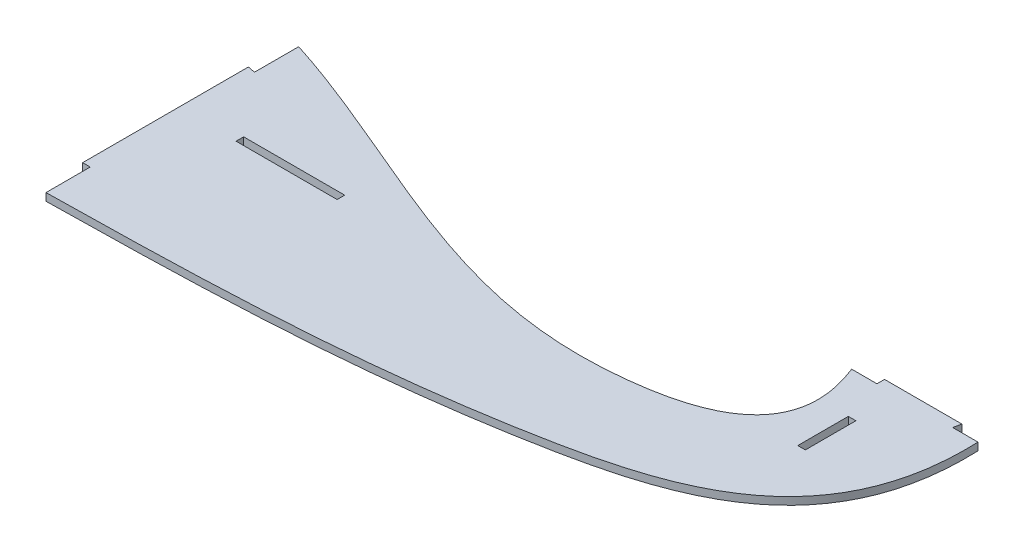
ISO-10303-21;
HEADER;
FILE_DESCRIPTION(('STEP AP214'),'2;1');
FILE_NAME('part.step','',(''),(''),'','','');
FILE_SCHEMA(('AUTOMOTIVE_DESIGN { 1 0 10303 214 1 1 1 1 }'));
ENDSEC;
DATA;
#1=APPLICATION_CONTEXT('core data for automotive mechanical design processes');
#2=APPLICATION_PROTOCOL_DEFINITION('international standard','automotive_design',2000,#1);
#3=PRODUCT_CONTEXT('',#1,'mechanical');
#4=PRODUCT('Part','Part','',(#3));
#5=PRODUCT_RELATED_PRODUCT_CATEGORY('part','',(#4));
#6=PRODUCT_DEFINITION_FORMATION('','',#4);
#7=PRODUCT_DEFINITION_CONTEXT('part definition',#1,'design');
#8=PRODUCT_DEFINITION('design','',#6,#7);
#9=PRODUCT_DEFINITION_SHAPE('','',#8);
#10=(LENGTH_UNIT() NAMED_UNIT(*) SI_UNIT(.MILLI.,.METRE.));
#11=(NAMED_UNIT(*) PLANE_ANGLE_UNIT() SI_UNIT($,.RADIAN.));
#12=(NAMED_UNIT(*) SI_UNIT($,.STERADIAN.) SOLID_ANGLE_UNIT());
#13=UNCERTAINTY_MEASURE_WITH_UNIT(LENGTH_MEASURE(1.E-05),#10,'distance_accuracy_value','');
#14=(GEOMETRIC_REPRESENTATION_CONTEXT(3) GLOBAL_UNCERTAINTY_ASSIGNED_CONTEXT((#13)) GLOBAL_UNIT_ASSIGNED_CONTEXT((#10,
#11,#12)) REPRESENTATION_CONTEXT('',''));
#15=CARTESIAN_POINT('',(0.,0.,0.));
#16=DIRECTION('',(0.,0.,1.));
#17=DIRECTION('',(1.,0.,0.));
#18=AXIS2_PLACEMENT_3D('',#15,#16,#17);
#19=CARTESIAN_POINT('',(-49.2266900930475,3.,7.72471878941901));
#20=DIRECTION('',(0.,-1.,0.));
#21=DIRECTION('',(0.,0.,-1.));
#22=AXIS2_PLACEMENT_3D('',#19,#20,#21);
#23=PLANE('',#22);
#24=DIRECTION('',(0.,0.,1.));
#25=VECTOR('',#24,1.);
#26=CARTESIAN_POINT('',(-186.035113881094,3.,-40.7173480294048));
#27=LINE('',#26,#25);
#28=CARTESIAN_POINT('',(-186.035113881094,3.,-40.7173480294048));
#29=VERTEX_POINT('',#28);
#30=CARTESIAN_POINT('',(-186.035113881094,3.,-37.7173480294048));
#31=VERTEX_POINT('',#30);
#32=EDGE_CURVE('E206',#29,#31,#27,.T.);
#33=ORIENTED_EDGE('',*,*,#32,.F.);
#34=DIRECTION('',(-1.,0.,0.));
#35=VECTOR('',#34,1.);
#36=CARTESIAN_POINT('',(-186.035113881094,3.,-40.7173480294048));
#37=LINE('',#36,#35);
#38=CARTESIAN_POINT('',(-146.035113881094,3.,-40.7173480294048));
#39=VERTEX_POINT('',#38);
#40=EDGE_CURVE('E214',#39,#29,#37,.T.);
#41=ORIENTED_EDGE('',*,*,#40,.F.);
#42=DIRECTION('',(0.,0.,-1.));
#43=VECTOR('',#42,1.);
#44=CARTESIAN_POINT('',(-146.035113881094,3.,-40.7173480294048));
#45=LINE('',#44,#43);
#46=CARTESIAN_POINT('',(-146.035113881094,3.,-37.7173480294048));
#47=VERTEX_POINT('',#46);
#48=EDGE_CURVE('E211',#47,#39,#45,.T.);
#49=ORIENTED_EDGE('',*,*,#48,.F.);
#50=DIRECTION('',(1.,0.,0.));
#51=VECTOR('',#50,1.);
#52=CARTESIAN_POINT('',(-186.035113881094,3.,-37.7173480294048));
#53=LINE('',#52,#51);
#54=EDGE_CURVE('E208',#31,#47,#53,.T.);
#55=ORIENTED_EDGE('',*,*,#54,.F.);
#56=EDGE_LOOP('',(#33,#41,#49,#55));
#57=FACE_BOUND('',#56,.T.);
#58=DIRECTION('',(-0.98058067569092,0.,-0.196116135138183));
#59=VECTOR('',#58,1.);
#60=CARTESIAN_POINT('',(-206.035113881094,3.,-65.));
#61=LINE('',#60,#59);
#62=CARTESIAN_POINT('',(-206.035113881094,3.,-65.));
#63=VERTEX_POINT('',#62);
#64=CARTESIAN_POINT('',(-209.035113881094,3.,-65.6));
#65=VERTEX_POINT('',#64);
#66=EDGE_CURVE('E237',#63,#65,#61,.T.);
#67=ORIENTED_EDGE('',*,*,#66,.T.);
#68=DIRECTION('',(0.,0.,1.));
#69=VECTOR('',#68,1.);
#70=CARTESIAN_POINT('',(-209.035113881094,3.,-65.6));
#71=LINE('',#70,#69);
#72=CARTESIAN_POINT('',(-209.035113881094,3.,0.));
#73=VERTEX_POINT('',#72);
#74=EDGE_CURVE('E240',#65,#73,#71,.T.);
#75=ORIENTED_EDGE('',*,*,#74,.T.);
#76=DIRECTION('',(1.,0.,0.));
#77=VECTOR('',#76,1.);
#78=CARTESIAN_POINT('',(-209.035113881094,3.,0.));
#79=LINE('',#78,#77);
#80=CARTESIAN_POINT('',(-206.035113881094,3.,0.));
#81=VERTEX_POINT('',#80);
#82=EDGE_CURVE('E243',#73,#81,#79,.T.);
#83=ORIENTED_EDGE('',*,*,#82,.T.);
#84=DIRECTION('',(0.,0.,1.));
#85=VECTOR('',#84,1.);
#86=CARTESIAN_POINT('',(-206.035113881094,3.,0.));
#87=LINE('',#86,#85);
#88=CARTESIAN_POINT('',(-206.035113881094,3.,17.5));
#89=VERTEX_POINT('',#88);
#90=EDGE_CURVE('E245',#81,#89,#87,.T.);
#91=ORIENTED_EDGE('',*,*,#90,.T.);
#92=CARTESIAN_POINT('',(-206.035113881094,3.,17.5));
#93=CARTESIAN_POINT('',(-144.452135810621,3.,16.5478589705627));
#94=CARTESIAN_POINT('',(-43.3392895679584,3.,14.1173539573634));
#95=CARTESIAN_POINT('',(66.3683103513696,3.,-18.6536348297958));
#96=CARTESIAN_POINT('',(63.928148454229,3.,-81.402504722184));
#97=B_SPLINE_CURVE_WITH_KNOTS('',3,(#92,#93,#94,#95,#96),.UNSPECIFIED.,.F.,.F.,(4,1,4),(0.,
0.576577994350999,1.),.UNSPECIFIED.);
#98=CARTESIAN_POINT('',(63.928148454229,3.,-81.402504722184));
#99=VERTEX_POINT('',#98);
#100=EDGE_CURVE('E247',#89,#99,#97,.T.);
#101=ORIENTED_EDGE('',*,*,#100,.T.);
#102=DIRECTION('',(-1.,0.,0.));
#103=VECTOR('',#102,1.);
#104=CARTESIAN_POINT('',(53.9281484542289,3.,-81.402504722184));
#105=LINE('',#104,#103);
#106=CARTESIAN_POINT('',(53.9281484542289,3.,-81.402504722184));
#107=VERTEX_POINT('',#106);
#108=EDGE_CURVE('E252',#99,#107,#105,.T.);
#109=ORIENTED_EDGE('',*,*,#108,.T.);
#110=DIRECTION('',(0.196116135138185,0.,-0.98058067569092));
#111=VECTOR('',#110,1.);
#112=CARTESIAN_POINT('',(53.9281484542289,3.,-81.402504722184));
#113=LINE('',#112,#111);
#114=CARTESIAN_POINT('',(54.5281484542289,3.,-84.402504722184));
#115=VERTEX_POINT('',#114);
#116=EDGE_CURVE('E425',#107,#115,#113,.T.);
#117=ORIENTED_EDGE('',*,*,#116,.T.);
#118=DIRECTION('',(-1.,0.,0.));
#119=VECTOR('',#118,1.);
#120=CARTESIAN_POINT('',(54.5281484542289,3.,-84.402504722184));
#121=LINE('',#120,#119);
#122=CARTESIAN_POINT('',(23.9281484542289,3.,-84.402504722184));
#123=VERTEX_POINT('',#122);
#124=EDGE_CURVE('E420',#115,#123,#121,.T.);
#125=ORIENTED_EDGE('',*,*,#124,.T.);
#126=DIRECTION('',(0.,0.,1.));
#127=VECTOR('',#126,1.);
#128=CARTESIAN_POINT('',(23.9281484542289,3.,-81.402504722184));
#129=LINE('',#128,#127);
#130=CARTESIAN_POINT('',(23.9281484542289,3.,-81.402504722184));
#131=VERTEX_POINT('',#130);
#132=EDGE_CURVE('E416',#123,#131,#129,.T.);
#133=ORIENTED_EDGE('',*,*,#132,.T.);
#134=DIRECTION('',(-1.,0.,0.));
#135=VECTOR('',#134,1.);
#136=CARTESIAN_POINT('',(13.9281484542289,3.,-81.402504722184));
#137=LINE('',#136,#135);
#138=CARTESIAN_POINT('',(13.9281484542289,3.,-81.402504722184));
#139=VERTEX_POINT('',#138);
#140=EDGE_CURVE('E312',#131,#139,#137,.T.);
#141=ORIENTED_EDGE('',*,*,#140,.T.);
#142=CARTESIAN_POINT('',(13.9281484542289,3.,-81.402504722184));
#143=CARTESIAN_POINT('',(27.9213090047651,3.,-46.249992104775));
#144=CARTESIAN_POINT('',(-17.8825562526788,3.,-30.4404603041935));
#145=CARTESIAN_POINT('',(-103.735826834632,3.,-34.1507342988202));
#146=CARTESIAN_POINT('',(-161.754644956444,3.,-68.5041270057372));
#147=CARTESIAN_POINT('',(-206.035113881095,3.,-82.5));
#148=B_SPLINE_CURVE_WITH_KNOTS('',3,(#142,#143,#144,#145,#146,#147),.UNSPECIFIED.,.F.,.F.,(4,1,
1,4),(0.,0.276728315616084,0.458837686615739,1.),.UNSPECIFIED.);
#149=CARTESIAN_POINT('',(-206.035113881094,3.,-82.5));
#150=VERTEX_POINT('',#149);
#151=EDGE_CURVE('E305',#139,#150,#148,.T.);
#152=ORIENTED_EDGE('',*,*,#151,.T.);
#153=DIRECTION('',(0.,0.,1.));
#154=VECTOR('',#153,1.);
#155=CARTESIAN_POINT('',(-206.035113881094,3.,-82.5));
#156=LINE('',#155,#154);
#157=EDGE_CURVE('E311',#150,#63,#156,.T.);
#158=ORIENTED_EDGE('',*,*,#157,.T.);
#159=EDGE_LOOP('',(#67,#75,#83,#91,#101,#109,#117,#125,#133,#141,#152,#158));
#160=FACE_BOUND('',#159,.T.);
#161=DIRECTION('',(0.,0.,1.));
#162=VECTOR('',#161,1.);
#163=CARTESIAN_POINT('',(29.4459579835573,3.,-64.5480450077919));
#164=LINE('',#163,#162);
#165=CARTESIAN_POINT('',(29.4459579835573,3.,-64.5480450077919));
#166=VERTEX_POINT('',#165);
#167=CARTESIAN_POINT('',(29.4459579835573,3.,-44.5480450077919));
#168=VERTEX_POINT('',#167);
#169=EDGE_CURVE('E170',#166,#168,#164,.T.);
#170=ORIENTED_EDGE('',*,*,#169,.F.);
#171=DIRECTION('',(-1.,0.,0.));
#172=VECTOR('',#171,1.);
#173=CARTESIAN_POINT('',(29.4459579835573,3.,-64.5480450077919));
#174=LINE('',#173,#172);
#175=CARTESIAN_POINT('',(32.4459579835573,3.,-64.5480450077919));
#176=VERTEX_POINT('',#175);
#177=EDGE_CURVE('E192',#176,#166,#174,.T.);
#178=ORIENTED_EDGE('',*,*,#177,.F.);
#179=DIRECTION('',(0.,0.,-1.));
#180=VECTOR('',#179,1.);
#181=CARTESIAN_POINT('',(32.4459579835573,3.,-64.5480450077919));
#182=LINE('',#181,#180);
#183=CARTESIAN_POINT('',(32.4459579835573,3.,-44.5480450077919));
#184=VERTEX_POINT('',#183);
#185=EDGE_CURVE('E190',#184,#176,#182,.T.);
#186=ORIENTED_EDGE('',*,*,#185,.F.);
#187=DIRECTION('',(1.,0.,0.));
#188=VECTOR('',#187,1.);
#189=CARTESIAN_POINT('',(29.4459579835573,3.,-44.5480450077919));
#190=LINE('',#189,#188);
#191=EDGE_CURVE('E178',#168,#184,#190,.T.);
#192=ORIENTED_EDGE('',*,*,#191,.F.);
#193=EDGE_LOOP('',(#170,#178,#186,#192));
#194=FACE_BOUND('',#193,.T.);
#195=ADVANCED_FACE('F33',(#57,#160,#194),#23,.F.);
#196=CARTESIAN_POINT('',(-49.2266900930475,0.,7.72471878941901));
#197=DIRECTION('',(0.,-1.,0.));
#198=DIRECTION('',(0.,0.,-1.));
#199=AXIS2_PLACEMENT_3D('',#196,#197,#198);
#200=PLANE('',#199);
#201=DIRECTION('',(-0.98058067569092,0.,-0.196116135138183));
#202=VECTOR('',#201,1.);
#203=CARTESIAN_POINT('',(-206.035113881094,0.,-65.));
#204=LINE('',#203,#202);
#205=CARTESIAN_POINT('',(-206.035113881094,0.,-65.));
#206=VERTEX_POINT('',#205);
#207=CARTESIAN_POINT('',(-209.035113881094,0.,-65.6));
#208=VERTEX_POINT('',#207);
#209=EDGE_CURVE('E236',#206,#208,#204,.T.);
#210=ORIENTED_EDGE('',*,*,#209,.F.);
#211=DIRECTION('',(0.,0.,1.));
#212=VECTOR('',#211,1.);
#213=CARTESIAN_POINT('',(-206.035113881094,0.,-82.5));
#214=LINE('',#213,#212);
#215=CARTESIAN_POINT('',(-206.035113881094,0.,-82.5));
#216=VERTEX_POINT('',#215);
#217=EDGE_CURVE('E241',#216,#206,#214,.T.);
#218=ORIENTED_EDGE('',*,*,#217,.F.);
#219=CARTESIAN_POINT('',(13.9281484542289,0.,-81.402504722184));
#220=CARTESIAN_POINT('',(27.9213090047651,0.,-46.249992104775));
#221=CARTESIAN_POINT('',(-17.8825562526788,0.,-30.4404603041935));
#222=CARTESIAN_POINT('',(-103.735826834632,0.,-34.1507342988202));
#223=CARTESIAN_POINT('',(-161.754644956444,0.,-68.5041270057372));
#224=CARTESIAN_POINT('',(-206.035113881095,0.,-82.5));
#225=B_SPLINE_CURVE_WITH_KNOTS('',3,(#219,#220,#221,#222,#223,#224),.UNSPECIFIED.,.F.,.F.,(4,1,
1,4),(0.,0.276728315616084,0.458837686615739,1.),.UNSPECIFIED.);
#226=CARTESIAN_POINT('',(13.9281484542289,0.,-81.402504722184));
#227=VERTEX_POINT('',#226);
#228=EDGE_CURVE('E345',#227,#216,#225,.T.);
#229=ORIENTED_EDGE('',*,*,#228,.F.);
#230=DIRECTION('',(-1.,0.,0.));
#231=VECTOR('',#230,1.);
#232=CARTESIAN_POINT('',(13.9281484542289,0.,-81.402504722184));
#233=LINE('',#232,#231);
#234=CARTESIAN_POINT('',(23.9281484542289,0.,-81.402504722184));
#235=VERTEX_POINT('',#234);
#236=EDGE_CURVE('E343',#235,#227,#233,.T.);
#237=ORIENTED_EDGE('',*,*,#236,.F.);
#238=DIRECTION('',(0.,0.,1.));
#239=VECTOR('',#238,1.);
#240=CARTESIAN_POINT('',(23.9281484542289,0.,-81.402504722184));
#241=LINE('',#240,#239);
#242=CARTESIAN_POINT('',(23.9281484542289,0.,-84.402504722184));
#243=VERTEX_POINT('',#242);
#244=EDGE_CURVE('E341',#243,#235,#241,.T.);
#245=ORIENTED_EDGE('',*,*,#244,.F.);
#246=DIRECTION('',(-1.,0.,0.));
#247=VECTOR('',#246,1.);
#248=CARTESIAN_POINT('',(23.9281484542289,0.,-84.402504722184));
#249=LINE('',#248,#247);
#250=CARTESIAN_POINT('',(54.5281484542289,0.,-84.402504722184));
#251=VERTEX_POINT('',#250);
#252=EDGE_CURVE('E339',#251,#243,#249,.T.);
#253=ORIENTED_EDGE('',*,*,#252,.F.);
#254=DIRECTION('',(0.196116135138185,0.,-0.98058067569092));
#255=VECTOR('',#254,1.);
#256=CARTESIAN_POINT('',(53.9281484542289,0.,-81.402504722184));
#257=LINE('',#256,#255);
#258=CARTESIAN_POINT('',(53.9281484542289,0.,-81.402504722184));
#259=VERTEX_POINT('',#258);
#260=EDGE_CURVE('E336',#259,#251,#257,.T.);
#261=ORIENTED_EDGE('',*,*,#260,.F.);
#262=DIRECTION('',(-1.,0.,0.));
#263=VECTOR('',#262,1.);
#264=CARTESIAN_POINT('',(53.9281484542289,0.,-81.402504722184));
#265=LINE('',#264,#263);
#266=CARTESIAN_POINT('',(63.928148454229,0.,-81.402504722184));
#267=VERTEX_POINT('',#266);
#268=EDGE_CURVE('E331',#267,#259,#265,.T.);
#269=ORIENTED_EDGE('',*,*,#268,.F.);
#270=CARTESIAN_POINT('',(-206.035113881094,0.,17.5));
#271=CARTESIAN_POINT('',(-144.452135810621,0.,16.5478589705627));
#272=CARTESIAN_POINT('',(-43.3392895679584,0.,14.1173539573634));
#273=CARTESIAN_POINT('',(66.3683103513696,0.,-18.6536348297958));
#274=CARTESIAN_POINT('',(63.928148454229,0.,-81.402504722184));
#275=B_SPLINE_CURVE_WITH_KNOTS('',3,(#270,#271,#272,#273,#274),.UNSPECIFIED.,.F.,.F.,(4,1,4),
(0.,0.576577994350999,1.),.UNSPECIFIED.);
#276=CARTESIAN_POINT('',(-206.035113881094,0.,17.5));
#277=VERTEX_POINT('',#276);
#278=EDGE_CURVE('E327',#277,#267,#275,.T.);
#279=ORIENTED_EDGE('',*,*,#278,.F.);
#280=DIRECTION('',(0.,0.,1.));
#281=VECTOR('',#280,1.);
#282=CARTESIAN_POINT('',(-206.035113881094,0.,0.));
#283=LINE('',#282,#281);
#284=CARTESIAN_POINT('',(-206.035113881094,0.,0.));
#285=VERTEX_POINT('',#284);
#286=EDGE_CURVE('E325',#285,#277,#283,.T.);
#287=ORIENTED_EDGE('',*,*,#286,.F.);
#288=DIRECTION('',(1.,0.,0.));
#289=VECTOR('',#288,1.);
#290=CARTESIAN_POINT('',(-209.035113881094,0.,0.));
#291=LINE('',#290,#289);
#292=CARTESIAN_POINT('',(-209.035113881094,0.,0.));
#293=VERTEX_POINT('',#292);
#294=EDGE_CURVE('E323',#293,#285,#291,.T.);
#295=ORIENTED_EDGE('',*,*,#294,.F.);
#296=DIRECTION('',(0.,0.,1.));
#297=VECTOR('',#296,1.);
#298=CARTESIAN_POINT('',(-209.035113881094,0.,-65.));
#299=LINE('',#298,#297);
#300=EDGE_CURVE('E321',#208,#293,#299,.T.);
#301=ORIENTED_EDGE('',*,*,#300,.F.);
#302=EDGE_LOOP('',(#210,#218,#229,#237,#245,#253,#261,#269,#279,#287,#295,#301));
#303=FACE_BOUND('',#302,.T.);
#304=DIRECTION('',(-1.,0.,0.));
#305=VECTOR('',#304,1.);
#306=CARTESIAN_POINT('',(-186.035113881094,0.,-40.7173480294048));
#307=LINE('',#306,#305);
#308=CARTESIAN_POINT('',(-146.035113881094,0.,-40.7173480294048));
#309=VERTEX_POINT('',#308);
#310=CARTESIAN_POINT('',(-186.035113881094,0.,-40.7173480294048));
#311=VERTEX_POINT('',#310);
#312=EDGE_CURVE('E209',#309,#311,#307,.T.);
#313=ORIENTED_EDGE('',*,*,#312,.T.);
#314=DIRECTION('',(0.,0.,1.));
#315=VECTOR('',#314,1.);
#316=CARTESIAN_POINT('',(-186.035113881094,0.,-40.7173480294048));
#317=LINE('',#316,#315);
#318=CARTESIAN_POINT('',(-186.035113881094,0.,-37.7173480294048));
#319=VERTEX_POINT('',#318);
#320=EDGE_CURVE('E186',#311,#319,#317,.T.);
#321=ORIENTED_EDGE('',*,*,#320,.T.);
#322=DIRECTION('',(1.,0.,0.));
#323=VECTOR('',#322,1.);
#324=CARTESIAN_POINT('',(-186.035113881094,0.,-37.7173480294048));
#325=LINE('',#324,#323);
#326=CARTESIAN_POINT('',(-146.035113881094,0.,-37.7173480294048));
#327=VERTEX_POINT('',#326);
#328=EDGE_CURVE('E219',#319,#327,#325,.T.);
#329=ORIENTED_EDGE('',*,*,#328,.T.);
#330=DIRECTION('',(0.,0.,-1.));
#331=VECTOR('',#330,1.);
#332=CARTESIAN_POINT('',(-146.035113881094,0.,-40.7173480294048));
#333=LINE('',#332,#331);
#334=EDGE_CURVE('E222',#327,#309,#333,.T.);
#335=ORIENTED_EDGE('',*,*,#334,.T.);
#336=EDGE_LOOP('',(#313,#321,#329,#335));
#337=FACE_BOUND('',#336,.T.);
#338=DIRECTION('',(-1.,0.,0.));
#339=VECTOR('',#338,1.);
#340=CARTESIAN_POINT('',(29.4459579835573,0.,-64.5480450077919));
#341=LINE('',#340,#339);
#342=CARTESIAN_POINT('',(32.4459579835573,0.,-64.5480450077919));
#343=VERTEX_POINT('',#342);
#344=CARTESIAN_POINT('',(29.4459579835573,0.,-64.5480450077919));
#345=VERTEX_POINT('',#344);
#346=EDGE_CURVE('E179',#343,#345,#341,.T.);
#347=ORIENTED_EDGE('',*,*,#346,.T.);
#348=DIRECTION('',(0.,0.,1.));
#349=VECTOR('',#348,1.);
#350=CARTESIAN_POINT('',(29.4459579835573,0.,-64.5480450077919));
#351=LINE('',#350,#349);
#352=CARTESIAN_POINT('',(29.4459579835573,0.,-44.5480450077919));
#353=VERTEX_POINT('',#352);
#354=EDGE_CURVE('E56',#345,#353,#351,.T.);
#355=ORIENTED_EDGE('',*,*,#354,.T.);
#356=DIRECTION('',(1.,0.,0.));
#357=VECTOR('',#356,1.);
#358=CARTESIAN_POINT('',(29.4459579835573,0.,-44.5480450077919));
#359=LINE('',#358,#357);
#360=CARTESIAN_POINT('',(32.4459579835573,0.,-44.5480450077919));
#361=VERTEX_POINT('',#360);
#362=EDGE_CURVE('E185',#353,#361,#359,.T.);
#363=ORIENTED_EDGE('',*,*,#362,.T.);
#364=DIRECTION('',(0.,0.,-1.));
#365=VECTOR('',#364,1.);
#366=CARTESIAN_POINT('',(32.4459579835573,0.,-64.5480450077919));
#367=LINE('',#366,#365);
#368=EDGE_CURVE('E198',#361,#343,#367,.T.);
#369=ORIENTED_EDGE('',*,*,#368,.T.);
#370=EDGE_LOOP('',(#347,#355,#363,#369));
#371=FACE_BOUND('',#370,.T.);
#372=ADVANCED_FACE('F278',(#303,#337,#371),#200,.T.);
#373=CARTESIAN_POINT('',(-206.035113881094,3.,-65.));
#374=DIRECTION('',(-0.196116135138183,0.,0.98058067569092));
#375=DIRECTION('',(0.98058067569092,0.,0.196116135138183));
#376=AXIS2_PLACEMENT_3D('',#373,#374,#375);
#377=PLANE('',#376);
#378=ORIENTED_EDGE('',*,*,#209,.T.);
#379=DIRECTION('',(0.,-1.,0.));
#380=VECTOR('',#379,1.);
#381=CARTESIAN_POINT('',(-209.035113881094,3.,-65.6));
#382=LINE('',#381,#380);
#383=EDGE_CURVE('E11',#65,#208,#382,.T.);
#384=ORIENTED_EDGE('',*,*,#383,.F.);
#385=ORIENTED_EDGE('',*,*,#66,.F.);
#386=DIRECTION('',(0.,-1.,0.));
#387=VECTOR('',#386,1.);
#388=CARTESIAN_POINT('',(-206.035113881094,3.,-65.));
#389=LINE('',#388,#387);
#390=EDGE_CURVE('E318',#63,#206,#389,.T.);
#391=ORIENTED_EDGE('',*,*,#390,.T.);
#392=EDGE_LOOP('',(#378,#384,#385,#391));
#393=FACE_BOUND('',#392,.T.);
#394=ADVANCED_FACE('F35',(#393),#377,.F.);
#395=CARTESIAN_POINT('',(-209.035113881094,3.,-65.));
#396=DIRECTION('',(1.,0.,0.));
#397=DIRECTION('',(0.,0.,-1.));
#398=AXIS2_PLACEMENT_3D('',#395,#396,#397);
#399=PLANE('',#398);
#400=ORIENTED_EDGE('',*,*,#300,.T.);
#401=DIRECTION('',(0.,-1.,0.));
#402=VECTOR('',#401,1.);
#403=CARTESIAN_POINT('',(-209.035113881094,3.,0.));
#404=LINE('',#403,#402);
#405=EDGE_CURVE('E41',#73,#293,#404,.T.);
#406=ORIENTED_EDGE('',*,*,#405,.F.);
#407=ORIENTED_EDGE('',*,*,#74,.F.);
#408=ORIENTED_EDGE('',*,*,#383,.T.);
#409=EDGE_LOOP('',(#400,#406,#407,#408));
#410=FACE_BOUND('',#409,.T.);
#411=ADVANCED_FACE('F271',(#410),#399,.F.);
#412=CARTESIAN_POINT('',(-209.035113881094,3.,0.));
#413=DIRECTION('',(0.,0.,-1.));
#414=DIRECTION('',(-1.,0.,0.));
#415=AXIS2_PLACEMENT_3D('',#412,#413,#414);
#416=PLANE('',#415);
#417=ORIENTED_EDGE('',*,*,#294,.T.);
#418=DIRECTION('',(0.,-1.,0.));
#419=VECTOR('',#418,1.);
#420=CARTESIAN_POINT('',(-206.035113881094,3.,0.));
#421=LINE('',#420,#419);
#422=EDGE_CURVE('E379',#81,#285,#421,.T.);
#423=ORIENTED_EDGE('',*,*,#422,.F.);
#424=ORIENTED_EDGE('',*,*,#82,.F.);
#425=ORIENTED_EDGE('',*,*,#405,.T.);
#426=EDGE_LOOP('',(#417,#423,#424,#425));
#427=FACE_BOUND('',#426,.T.);
#428=ADVANCED_FACE('F268',(#427),#416,.F.);
#429=CARTESIAN_POINT('',(-206.035113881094,3.,0.));
#430=DIRECTION('',(1.,0.,0.));
#431=DIRECTION('',(0.,0.,-1.));
#432=AXIS2_PLACEMENT_3D('',#429,#430,#431);
#433=PLANE('',#432);
#434=ORIENTED_EDGE('',*,*,#286,.T.);
#435=DIRECTION('',(0.,-1.,0.));
#436=VECTOR('',#435,1.);
#437=CARTESIAN_POINT('',(-206.035113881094,3.,17.5));
#438=LINE('',#437,#436);
#439=EDGE_CURVE('E376',#89,#277,#438,.T.);
#440=ORIENTED_EDGE('',*,*,#439,.F.);
#441=ORIENTED_EDGE('',*,*,#90,.F.);
#442=ORIENTED_EDGE('',*,*,#422,.T.);
#443=EDGE_LOOP('',(#434,#440,#441,#442));
#444=FACE_BOUND('',#443,.T.);
#445=ADVANCED_FACE('F263',(#444),#433,.F.);
#446=DIRECTION('',(0.,-1.,0.));
#447=VECTOR('',#446,1.);
#448=SURFACE_OF_LINEAR_EXTRUSION('',#97,#447);
#449=ORIENTED_EDGE('',*,*,#278,.T.);
#450=DIRECTION('',(0.,-1.,0.));
#451=VECTOR('',#450,1.);
#452=CARTESIAN_POINT('',(63.928148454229,3.,-81.402504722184));
#453=LINE('',#452,#451);
#454=EDGE_CURVE('E373',#99,#267,#453,.T.);
#455=ORIENTED_EDGE('',*,*,#454,.F.);
#456=ORIENTED_EDGE('',*,*,#100,.F.);
#457=ORIENTED_EDGE('',*,*,#439,.T.);
#458=EDGE_LOOP('',(#449,#455,#456,#457));
#459=FACE_BOUND('',#458,.T.);
#460=ADVANCED_FACE('F258',(#459),#448,.F.);
#461=CARTESIAN_POINT('',(53.9281484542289,3.,-81.402504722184));
#462=DIRECTION('',(0.,0.,1.));
#463=DIRECTION('',(1.,0.,0.));
#464=AXIS2_PLACEMENT_3D('',#461,#462,#463);
#465=PLANE('',#464);
#466=ORIENTED_EDGE('',*,*,#268,.T.);
#467=DIRECTION('',(0.,-1.,0.));
#468=VECTOR('',#467,1.);
#469=CARTESIAN_POINT('',(53.9281484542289,3.,-81.402504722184));
#470=LINE('',#469,#468);
#471=EDGE_CURVE('E370',#107,#259,#470,.T.);
#472=ORIENTED_EDGE('',*,*,#471,.F.);
#473=ORIENTED_EDGE('',*,*,#108,.F.);
#474=ORIENTED_EDGE('',*,*,#454,.T.);
#475=EDGE_LOOP('',(#466,#472,#473,#474));
#476=FACE_BOUND('',#475,.T.);
#477=ADVANCED_FACE('F262',(#476),#465,.F.);
#478=CARTESIAN_POINT('',(53.9281484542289,3.,-81.402504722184));
#479=DIRECTION('',(-0.98058067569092,0.,-0.196116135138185));
#480=DIRECTION('',(-0.196116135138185,0.,0.98058067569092));
#481=AXIS2_PLACEMENT_3D('',#478,#479,#480);
#482=PLANE('',#481);
#483=ORIENTED_EDGE('',*,*,#260,.T.);
#484=DIRECTION('',(0.,-1.,0.));
#485=VECTOR('',#484,1.);
#486=CARTESIAN_POINT('',(54.5281484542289,3.,-84.402504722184));
#487=LINE('',#486,#485);
#488=EDGE_CURVE('E367',#115,#251,#487,.T.);
#489=ORIENTED_EDGE('',*,*,#488,.F.);
#490=ORIENTED_EDGE('',*,*,#116,.F.);
#491=ORIENTED_EDGE('',*,*,#471,.T.);
#492=EDGE_LOOP('',(#483,#489,#490,#491));
#493=FACE_BOUND('',#492,.T.);
#494=ADVANCED_FACE('F424',(#493),#482,.F.);
#495=CARTESIAN_POINT('',(23.9281484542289,3.,-84.402504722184));
#496=DIRECTION('',(0.,0.,1.));
#497=DIRECTION('',(1.,0.,0.));
#498=AXIS2_PLACEMENT_3D('',#495,#496,#497);
#499=PLANE('',#498);
#500=ORIENTED_EDGE('',*,*,#252,.T.);
#501=DIRECTION('',(0.,-1.,0.));
#502=VECTOR('',#501,1.);
#503=CARTESIAN_POINT('',(23.9281484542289,3.,-84.402504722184));
#504=LINE('',#503,#502);
#505=EDGE_CURVE('E364',#123,#243,#504,.T.);
#506=ORIENTED_EDGE('',*,*,#505,.F.);
#507=ORIENTED_EDGE('',*,*,#124,.F.);
#508=ORIENTED_EDGE('',*,*,#488,.T.);
#509=EDGE_LOOP('',(#500,#506,#507,#508));
#510=FACE_BOUND('',#509,.T.);
#511=ADVANCED_FACE('F419',(#510),#499,.F.);
#512=CARTESIAN_POINT('',(23.9281484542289,3.,-81.402504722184));
#513=DIRECTION('',(1.,0.,0.));
#514=DIRECTION('',(0.,0.,-1.));
#515=AXIS2_PLACEMENT_3D('',#512,#513,#514);
#516=PLANE('',#515);
#517=ORIENTED_EDGE('',*,*,#244,.T.);
#518=DIRECTION('',(0.,-1.,0.));
#519=VECTOR('',#518,1.);
#520=CARTESIAN_POINT('',(23.9281484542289,3.,-81.402504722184));
#521=LINE('',#520,#519);
#522=EDGE_CURVE('E361',#131,#235,#521,.T.);
#523=ORIENTED_EDGE('',*,*,#522,.F.);
#524=ORIENTED_EDGE('',*,*,#132,.F.);
#525=ORIENTED_EDGE('',*,*,#505,.T.);
#526=EDGE_LOOP('',(#517,#523,#524,#525));
#527=FACE_BOUND('',#526,.T.);
#528=ADVANCED_FACE('F413',(#527),#516,.F.);
#529=CARTESIAN_POINT('',(13.9281484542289,3.,-81.402504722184));
#530=DIRECTION('',(0.,0.,1.));
#531=DIRECTION('',(1.,0.,0.));
#532=AXIS2_PLACEMENT_3D('',#529,#530,#531);
#533=PLANE('',#532);
#534=ORIENTED_EDGE('',*,*,#236,.T.);
#535=DIRECTION('',(0.,-1.,0.));
#536=VECTOR('',#535,1.);
#537=CARTESIAN_POINT('',(13.9281484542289,3.,-81.402504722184));
#538=LINE('',#537,#536);
#539=EDGE_CURVE('E358',#139,#227,#538,.T.);
#540=ORIENTED_EDGE('',*,*,#539,.F.);
#541=ORIENTED_EDGE('',*,*,#140,.F.);
#542=ORIENTED_EDGE('',*,*,#522,.T.);
#543=EDGE_LOOP('',(#534,#540,#541,#542));
#544=FACE_BOUND('',#543,.T.);
#545=ADVANCED_FACE('F302',(#544),#533,.F.);
#546=DIRECTION('',(0.,-1.,0.));
#547=VECTOR('',#546,1.);
#548=SURFACE_OF_LINEAR_EXTRUSION('',#148,#547);
#549=ORIENTED_EDGE('',*,*,#228,.T.);
#550=DIRECTION('',(0.,-1.,0.));
#551=VECTOR('',#550,1.);
#552=CARTESIAN_POINT('',(-206.035113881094,3.,-82.5));
#553=LINE('',#552,#551);
#554=EDGE_CURVE('E355',#150,#216,#553,.T.);
#555=ORIENTED_EDGE('',*,*,#554,.F.);
#556=ORIENTED_EDGE('',*,*,#151,.F.);
#557=ORIENTED_EDGE('',*,*,#539,.T.);
#558=EDGE_LOOP('',(#549,#555,#556,#557));
#559=FACE_BOUND('',#558,.T.);
#560=ADVANCED_FACE('F297',(#559),#548,.F.);
#561=CARTESIAN_POINT('',(-206.035113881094,3.,-82.5));
#562=DIRECTION('',(1.,0.,0.));
#563=DIRECTION('',(0.,0.,-1.));
#564=AXIS2_PLACEMENT_3D('',#561,#562,#563);
#565=PLANE('',#564);
#566=ORIENTED_EDGE('',*,*,#217,.T.);
#567=ORIENTED_EDGE('',*,*,#390,.F.);
#568=ORIENTED_EDGE('',*,*,#157,.F.);
#569=ORIENTED_EDGE('',*,*,#554,.T.);
#570=EDGE_LOOP('',(#566,#567,#568,#569));
#571=FACE_BOUND('',#570,.T.);
#572=ADVANCED_FACE('F294',(#571),#565,.F.);
#573=CARTESIAN_POINT('',(-186.035113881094,3.,-40.7173480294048));
#574=DIRECTION('',(1.,0.,0.));
#575=DIRECTION('',(0.,0.,-1.));
#576=AXIS2_PLACEMENT_3D('',#573,#574,#575);
#577=PLANE('',#576);
#578=ORIENTED_EDGE('',*,*,#320,.F.);
#579=DIRECTION('',(0.,-1.,0.));
#580=VECTOR('',#579,1.);
#581=CARTESIAN_POINT('',(-186.035113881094,3.,-40.7173480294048));
#582=LINE('',#581,#580);
#583=EDGE_CURVE('E216',#29,#311,#582,.T.);
#584=ORIENTED_EDGE('',*,*,#583,.F.);
#585=ORIENTED_EDGE('',*,*,#32,.T.);
#586=DIRECTION('',(0.,-1.,0.));
#587=VECTOR('',#586,1.);
#588=CARTESIAN_POINT('',(-186.035113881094,3.,-37.7173480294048));
#589=LINE('',#588,#587);
#590=EDGE_CURVE('E233',#31,#319,#589,.T.);
#591=ORIENTED_EDGE('',*,*,#590,.T.);
#592=EDGE_LOOP('',(#578,#584,#585,#591));
#593=FACE_BOUND('',#592,.T.);
#594=ADVANCED_FACE('F291',(#593),#577,.T.);
#595=CARTESIAN_POINT('',(-186.035113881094,3.,-37.7173480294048));
#596=DIRECTION('',(0.,0.,-1.));
#597=DIRECTION('',(-1.,0.,0.));
#598=AXIS2_PLACEMENT_3D('',#595,#596,#597);
#599=PLANE('',#598);
#600=ORIENTED_EDGE('',*,*,#328,.F.);
#601=ORIENTED_EDGE('',*,*,#590,.F.);
#602=ORIENTED_EDGE('',*,*,#54,.T.);
#603=DIRECTION('',(0.,-1.,0.));
#604=VECTOR('',#603,1.);
#605=CARTESIAN_POINT('',(-146.035113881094,3.,-37.7173480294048));
#606=LINE('',#605,#604);
#607=EDGE_CURVE('E231',#47,#327,#606,.T.);
#608=ORIENTED_EDGE('',*,*,#607,.T.);
#609=EDGE_LOOP('',(#600,#601,#602,#608));
#610=FACE_BOUND('',#609,.T.);
#611=ADVANCED_FACE('F456',(#610),#599,.T.);
#612=CARTESIAN_POINT('',(-146.035113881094,3.,-40.7173480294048));
#613=DIRECTION('',(-1.,0.,0.));
#614=DIRECTION('',(0.,0.,1.));
#615=AXIS2_PLACEMENT_3D('',#612,#613,#614);
#616=PLANE('',#615);
#617=ORIENTED_EDGE('',*,*,#334,.F.);
#618=ORIENTED_EDGE('',*,*,#607,.F.);
#619=ORIENTED_EDGE('',*,*,#48,.T.);
#620=DIRECTION('',(0.,-1.,0.));
#621=VECTOR('',#620,1.);
#622=CARTESIAN_POINT('',(-146.035113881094,3.,-40.7173480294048));
#623=LINE('',#622,#621);
#624=EDGE_CURVE('E229',#39,#309,#623,.T.);
#625=ORIENTED_EDGE('',*,*,#624,.T.);
#626=EDGE_LOOP('',(#617,#618,#619,#625));
#627=FACE_BOUND('',#626,.T.);
#628=ADVANCED_FACE('F463',(#627),#616,.T.);
#629=CARTESIAN_POINT('',(-186.035113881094,3.,-40.7173480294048));
#630=DIRECTION('',(0.,0.,1.));
#631=DIRECTION('',(1.,0.,0.));
#632=AXIS2_PLACEMENT_3D('',#629,#630,#631);
#633=PLANE('',#632);
#634=ORIENTED_EDGE('',*,*,#312,.F.);
#635=ORIENTED_EDGE('',*,*,#624,.F.);
#636=ORIENTED_EDGE('',*,*,#40,.T.);
#637=ORIENTED_EDGE('',*,*,#583,.T.);
#638=EDGE_LOOP('',(#634,#635,#636,#637));
#639=FACE_BOUND('',#638,.T.);
#640=ADVANCED_FACE('F470',(#639),#633,.T.);
#641=CARTESIAN_POINT('',(29.4459579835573,3.,-64.5480450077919));
#642=DIRECTION('',(1.,0.,0.));
#643=DIRECTION('',(0.,0.,-1.));
#644=AXIS2_PLACEMENT_3D('',#641,#642,#643);
#645=PLANE('',#644);
#646=ORIENTED_EDGE('',*,*,#354,.F.);
#647=DIRECTION('',(0.,-1.,0.));
#648=VECTOR('',#647,1.);
#649=CARTESIAN_POINT('',(29.4459579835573,3.,-64.5480450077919));
#650=LINE('',#649,#648);
#651=EDGE_CURVE('E174',#166,#345,#650,.T.);
#652=ORIENTED_EDGE('',*,*,#651,.F.);
#653=ORIENTED_EDGE('',*,*,#169,.T.);
#654=DIRECTION('',(0.,-1.,0.));
#655=VECTOR('',#654,1.);
#656=CARTESIAN_POINT('',(29.4459579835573,3.,-44.5480450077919));
#657=LINE('',#656,#655);
#658=EDGE_CURVE('E173',#168,#353,#657,.T.);
#659=ORIENTED_EDGE('',*,*,#658,.T.);
#660=EDGE_LOOP('',(#646,#652,#653,#659));
#661=FACE_BOUND('',#660,.T.);
#662=ADVANCED_FACE('F172',(#661),#645,.T.);
#663=CARTESIAN_POINT('',(29.4459579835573,3.,-44.5480450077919));
#664=DIRECTION('',(0.,0.,-1.));
#665=DIRECTION('',(-1.,0.,0.));
#666=AXIS2_PLACEMENT_3D('',#663,#664,#665);
#667=PLANE('',#666);
#668=ORIENTED_EDGE('',*,*,#362,.F.);
#669=ORIENTED_EDGE('',*,*,#658,.F.);
#670=ORIENTED_EDGE('',*,*,#191,.T.);
#671=DIRECTION('',(0.,-1.,0.));
#672=VECTOR('',#671,1.);
#673=CARTESIAN_POINT('',(32.4459579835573,3.,-44.5480450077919));
#674=LINE('',#673,#672);
#675=EDGE_CURVE('E187',#184,#361,#674,.T.);
#676=ORIENTED_EDGE('',*,*,#675,.T.);
#677=EDGE_LOOP('',(#668,#669,#670,#676));
#678=FACE_BOUND('',#677,.T.);
#679=ADVANCED_FACE('F182',(#678),#667,.T.);
#680=CARTESIAN_POINT('',(32.4459579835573,3.,-64.5480450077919));
#681=DIRECTION('',(-1.,0.,0.));
#682=DIRECTION('',(0.,0.,1.));
#683=AXIS2_PLACEMENT_3D('',#680,#681,#682);
#684=PLANE('',#683);
#685=ORIENTED_EDGE('',*,*,#368,.F.);
#686=ORIENTED_EDGE('',*,*,#675,.F.);
#687=ORIENTED_EDGE('',*,*,#185,.T.);
#688=DIRECTION('',(0.,-1.,0.));
#689=VECTOR('',#688,1.);
#690=CARTESIAN_POINT('',(32.4459579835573,3.,-64.5480450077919));
#691=LINE('',#690,#689);
#692=EDGE_CURVE('E48',#176,#343,#691,.T.);
#693=ORIENTED_EDGE('',*,*,#692,.T.);
#694=EDGE_LOOP('',(#685,#686,#687,#693));
#695=FACE_BOUND('',#694,.T.);
#696=ADVANCED_FACE('F491',(#695),#684,.T.);
#697=CARTESIAN_POINT('',(29.4459579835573,3.,-64.5480450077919));
#698=DIRECTION('',(0.,0.,1.));
#699=DIRECTION('',(1.,0.,0.));
#700=AXIS2_PLACEMENT_3D('',#697,#698,#699);
#701=PLANE('',#700);
#702=ORIENTED_EDGE('',*,*,#346,.F.);
#703=ORIENTED_EDGE('',*,*,#692,.F.);
#704=ORIENTED_EDGE('',*,*,#177,.T.);
#705=ORIENTED_EDGE('',*,*,#651,.T.);
#706=EDGE_LOOP('',(#702,#703,#704,#705));
#707=FACE_BOUND('',#706,.T.);
#708=ADVANCED_FACE('F498',(#707),#701,.T.);
#709=CLOSED_SHELL('',(#195,#372,#394,#411,#428,#445,#460,#477,#494,#511,#528,#545,#560,#572,
#594,#611,#628,#640,#662,#679,#696,#708));
#710=MANIFOLD_SOLID_BREP('B2',#709);
#711=ADVANCED_BREP_SHAPE_REPRESENTATION('',(#18,#710),#14);
#712=SHAPE_DEFINITION_REPRESENTATION(#9,#711);
ENDSEC;
END-ISO-10303-21;
